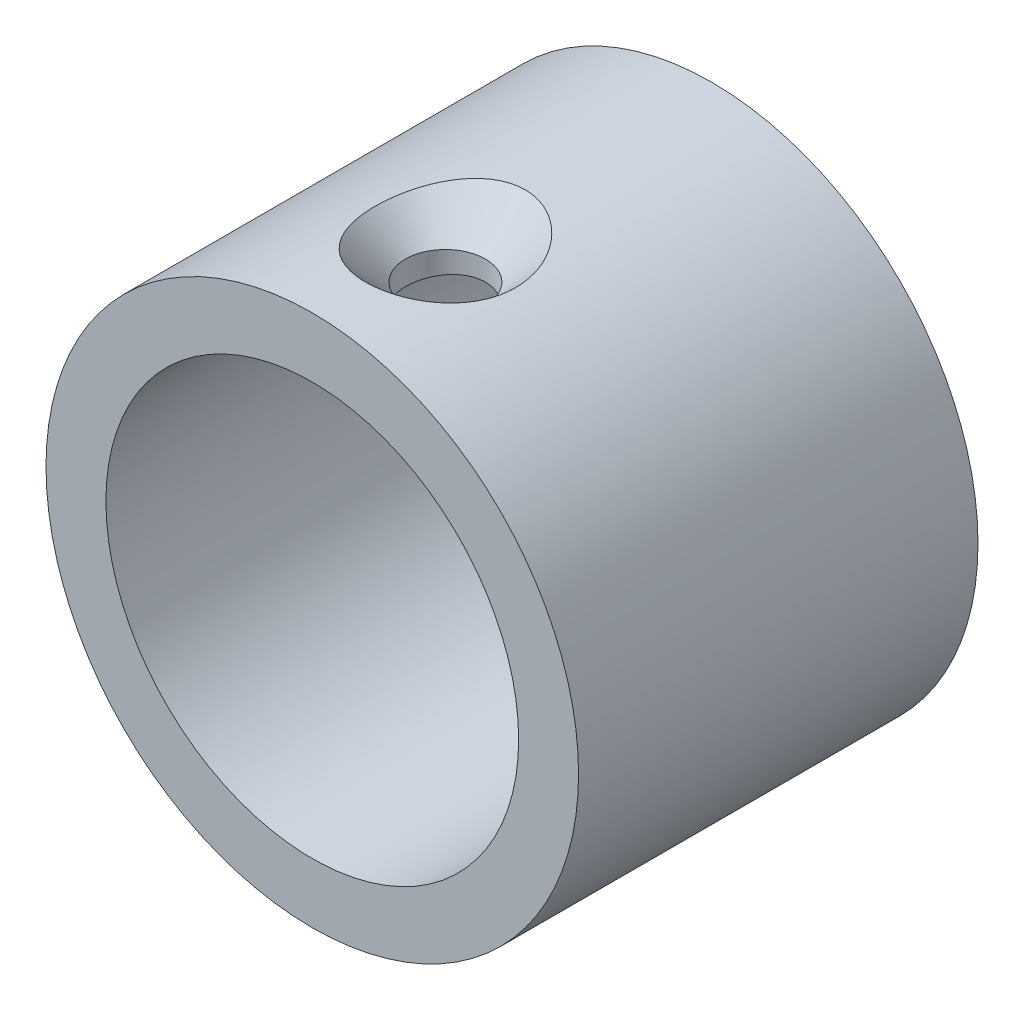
ISO-10303-21;
HEADER;
FILE_DESCRIPTION(('STEP AP214'),'2;1');
FILE_NAME('part.step','',(''),(''),'','','');
FILE_SCHEMA(('AUTOMOTIVE_DESIGN { 1 0 10303 214 1 1 1 1 }'));
ENDSEC;
DATA;
#1=APPLICATION_CONTEXT('core data for automotive mechanical design processes');
#2=APPLICATION_PROTOCOL_DEFINITION('international standard','automotive_design',2000,#1);
#3=PRODUCT_CONTEXT('',#1,'mechanical');
#4=PRODUCT('Part','Part','',(#3));
#5=PRODUCT_RELATED_PRODUCT_CATEGORY('part','',(#4));
#6=PRODUCT_DEFINITION_FORMATION('','',#4);
#7=PRODUCT_DEFINITION_CONTEXT('part definition',#1,'design');
#8=PRODUCT_DEFINITION('design','',#6,#7);
#9=PRODUCT_DEFINITION_SHAPE('','',#8);
#10=(LENGTH_UNIT() NAMED_UNIT(*) SI_UNIT(.MILLI.,.METRE.));
#11=(NAMED_UNIT(*) PLANE_ANGLE_UNIT() SI_UNIT($,.RADIAN.));
#12=(NAMED_UNIT(*) SI_UNIT($,.STERADIAN.) SOLID_ANGLE_UNIT());
#13=UNCERTAINTY_MEASURE_WITH_UNIT(LENGTH_MEASURE(1.E-05),#10,'distance_accuracy_value','');
#14=(GEOMETRIC_REPRESENTATION_CONTEXT(3) GLOBAL_UNCERTAINTY_ASSIGNED_CONTEXT((#13)) GLOBAL_UNIT_ASSIGNED_CONTEXT((#10,
#11,#12)) REPRESENTATION_CONTEXT('',''));
#15=CARTESIAN_POINT('',(0.,0.,0.));
#16=DIRECTION('',(0.,0.,1.));
#17=DIRECTION('',(1.,0.,0.));
#18=AXIS2_PLACEMENT_3D('',#15,#16,#17);
#19=CARTESIAN_POINT('',(0.,0.,15.));
#20=DIRECTION('',(0.,0.,-1.));
#21=DIRECTION('',(-1.,0.,0.));
#22=AXIS2_PLACEMENT_3D('',#19,#20,#21);
#23=CYLINDRICAL_SURFACE('',#22,15.5);
#24=CARTESIAN_POINT('',(0.,15.5,8.00000000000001));
#25=CARTESIAN_POINT('',(-0.16684215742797,15.4999969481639,7.99999373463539));
#26=CARTESIAN_POINT('',(-0.333764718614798,15.4972784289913,7.98603481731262));
#27=CARTESIAN_POINT('',(-0.662899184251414,15.4866958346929,7.93060790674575));
#28=CARTESIAN_POINT('',(-0.825107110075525,15.4788275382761,7.8891173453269));
#29=CARTESIAN_POINT('',(-1.14000531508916,15.4588248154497,7.77995076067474));
#30=CARTESIAN_POINT('',(-1.29270428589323,15.4466943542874,7.71229907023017));
#31=CARTESIAN_POINT('',(-1.58457198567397,15.4194891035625,7.55280123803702));
#32=CARTESIAN_POINT('',(-1.72374167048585,15.4044145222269,7.46095680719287));
#33=CARTESIAN_POINT('',(-1.98638335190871,15.3727681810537,7.25444093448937));
#34=CARTESIAN_POINT('',(-2.10965836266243,15.356181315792,7.13952126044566));
#35=CARTESIAN_POINT('',(-2.33530650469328,15.3234909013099,6.89065086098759));
#36=CARTESIAN_POINT('',(-2.43767807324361,15.3073873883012,6.75669871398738));
#37=CARTESIAN_POINT('',(-2.61944182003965,15.2773398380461,6.47216181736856));
#38=CARTESIAN_POINT('',(-2.6986319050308,15.2634152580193,6.32144573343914));
#39=CARTESIAN_POINT('',(-2.83049059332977,15.2395158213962,6.0085337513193));
#40=CARTESIAN_POINT('',(-2.88316164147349,15.2295406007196,5.84633891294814));
#41=CARTESIAN_POINT('',(-2.95985143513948,15.2148217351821,5.51718687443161));
#42=CARTESIAN_POINT('',(-2.98421471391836,15.2100152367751,5.3503128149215));
#43=CARTESIAN_POINT('',(-3.00466715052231,15.2059886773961,5.01478171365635));
#44=CARTESIAN_POINT('',(-3.0007590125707,15.2067680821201,4.84612484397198));
#45=CARTESIAN_POINT('',(-2.96505853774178,15.2137680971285,4.51432344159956));
#46=CARTESIAN_POINT('',(-2.93365948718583,15.2199119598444,4.35113473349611));
#47=CARTESIAN_POINT('',(-2.84448853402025,15.2368279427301,4.03238592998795));
#48=CARTESIAN_POINT('',(-2.78671544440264,15.2476002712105,3.87682617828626));
#49=CARTESIAN_POINT('',(-2.64605609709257,15.2726388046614,3.57660858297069));
#50=CARTESIAN_POINT('',(-2.56301242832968,15.2869267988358,3.43202638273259));
#51=CARTESIAN_POINT('',(-2.37428042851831,15.3173725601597,3.15870107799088));
#52=CARTESIAN_POINT('',(-2.26858965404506,15.3335305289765,3.0299596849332));
#53=CARTESIAN_POINT('',(-2.03545019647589,15.3662291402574,2.78969958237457));
#54=CARTESIAN_POINT('',(-1.90766546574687,15.3827716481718,2.67850695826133));
#55=CARTESIAN_POINT('',(-1.63508621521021,15.4141260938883,2.47908552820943));
#56=CARTESIAN_POINT('',(-1.49029150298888,15.4289380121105,2.39085698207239));
#57=CARTESIAN_POINT('',(-1.18745182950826,15.4551953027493,2.23981431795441));
#58=CARTESIAN_POINT('',(-1.02938872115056,15.4666359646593,2.1770357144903));
#59=CARTESIAN_POINT('',(-0.704689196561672,15.4848256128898,2.07901322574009));
#60=CARTESIAN_POINT('',(-0.538053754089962,15.4915751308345,2.04376622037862));
#61=CARTESIAN_POINT('',(-0.203743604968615,15.4995484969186,2.00226504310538));
#62=CARTESIAN_POINT('',(-0.0361262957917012,15.5008574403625,1.99556434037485));
#63=CARTESIAN_POINT('',(0.297833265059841,15.4980378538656,2.01014592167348));
#64=CARTESIAN_POINT('',(0.464175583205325,15.4939096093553,2.03142673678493));
#65=CARTESIAN_POINT('',(0.789435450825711,15.4807326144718,2.10099614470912));
#66=CARTESIAN_POINT('',(0.94840347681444,15.4717253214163,2.14905728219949));
#67=CARTESIAN_POINT('',(1.25602495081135,15.4497962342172,2.27057576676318));
#68=CARTESIAN_POINT('',(1.40467766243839,15.436874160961,2.34403492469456));
#69=CARTESIAN_POINT('',(1.6893437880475,15.4083367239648,2.51524188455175));
#70=CARTESIAN_POINT('',(1.82519124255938,15.3926919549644,2.61326062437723));
#71=CARTESIAN_POINT('',(2.07866993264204,15.3605171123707,2.83043956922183));
#72=CARTESIAN_POINT('',(2.19629934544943,15.3439869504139,2.94960188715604));
#73=CARTESIAN_POINT('',(2.41171234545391,15.3116199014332,3.20771236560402));
#74=CARTESIAN_POINT('',(2.50919032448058,15.2957961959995,3.346917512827));
#75=CARTESIAN_POINT('',(2.67938023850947,15.2669055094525,3.63998847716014));
#76=CARTESIAN_POINT('',(2.75209312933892,15.253838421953,3.79385372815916));
#77=CARTESIAN_POINT('',(2.87026314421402,15.2320453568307,4.11112581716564));
#78=CARTESIAN_POINT('',(2.91585659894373,15.2232977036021,4.2744803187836));
#79=CARTESIAN_POINT('',(2.97891074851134,15.2110861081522,4.60671767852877));
#80=CARTESIAN_POINT('',(2.99637485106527,15.2076215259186,4.77559986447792));
#81=CARTESIAN_POINT('',(3.00255473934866,15.2064022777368,5.11103410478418));
#82=CARTESIAN_POINT('',(2.99175298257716,15.208551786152,5.27757711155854));
#83=CARTESIAN_POINT('',(2.94276810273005,15.2181052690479,5.60642486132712));
#84=CARTESIAN_POINT('',(2.90458516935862,15.2255092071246,5.7687296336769));
#85=CARTESIAN_POINT('',(2.8021309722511,15.2446957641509,6.08421153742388));
#86=CARTESIAN_POINT('',(2.73791525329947,15.2564690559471,6.23740731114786));
#87=CARTESIAN_POINT('',(2.58527230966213,15.2830737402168,6.53092687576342));
#88=CARTESIAN_POINT('',(2.49684322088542,15.2979053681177,6.67124967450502));
#89=CARTESIAN_POINT('',(2.29662044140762,15.3292510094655,6.93744995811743));
#90=CARTESIAN_POINT('',(2.18447690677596,15.3457880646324,7.06306164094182));
#91=CARTESIAN_POINT('',(1.94073471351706,15.3785122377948,7.29384426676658));
#92=CARTESIAN_POINT('',(1.80913159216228,15.3946992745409,7.39901050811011));
#93=CARTESIAN_POINT('',(1.52867568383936,15.4250840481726,7.58687409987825));
#94=CARTESIAN_POINT('',(1.37966809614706,15.4392609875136,7.66934383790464));
#95=CARTESIAN_POINT('',(1.06968135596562,15.4638244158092,7.8079444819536));
#96=CARTESIAN_POINT('',(0.908713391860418,15.4742143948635,7.86409965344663));
#97=CARTESIAN_POINT('',(0.62277038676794,15.4879623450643,7.93732505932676));
#98=CARTESIAN_POINT('',(0.499446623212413,15.492450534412,7.96078717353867));
#99=CARTESIAN_POINT('',(0.250763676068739,15.4984704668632,7.99212677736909));
#100=CARTESIAN_POINT('',(0.125404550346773,15.5000022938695,8.00000470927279));
#101=CARTESIAN_POINT('',(0.,15.5,8.00000000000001));
#102=B_SPLINE_CURVE_WITH_KNOTS('',3,(#24,#25,#26,#27,#28,#29,#30,#31,#32,#33,#34,#35,#36,#37,
#38,#39,#40,#41,#42,#43,#44,#45,#46,#47,#48,#49,#50,#51,#52,#53,#54,#55,#56,#57,#58,#59,#60,#61,
#62,#63,#64,#65,#66,#67,#68,#69,#70,#71,#72,#73,#74,#75,#76,#77,#78,#79,#80,#81,#82,#83,#84,#85,
#86,#87,#88,#89,#90,#91,#92,#93,#94,#95,#96,#97,#98,#99,#100,#101),.UNSPECIFIED.,.T.,.F.,(4,2,2,
2,2,2,2,2,2,2,2,2,2,2,2,2,2,2,2,2,2,2,2,2,2,2,2,2,2,2,2,2,2,2,2,2,2,2,4),(0.,0.500067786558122,
1.0005459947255,1.50055981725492,2.00053828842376,2.50621507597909,3.01192965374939,
3.52192995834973,4.03188323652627,4.53556262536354,5.03919383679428,5.53573568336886,
6.03229987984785,6.53202279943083,7.0317996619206,7.53998224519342,8.0481705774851,
8.55706564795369,9.06590303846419,9.56675110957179,10.0675728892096,10.564204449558,
11.0608714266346,11.5632793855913,12.065737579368,12.5753323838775,13.0849075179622,
13.5918988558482,14.0988287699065,14.5971627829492,15.0954933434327,15.5927661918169,
16.090077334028,16.5953127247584,17.1006641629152,17.6109127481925,18.1206898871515,
18.4965694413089,18.8724383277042),.UNSPECIFIED.);
#103=CARTESIAN_POINT('',(0.,15.5,8.00000000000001));
#104=VERTEX_POINT('',#103);
#105=EDGE_CURVE('E39',#104,#104,#102,.T.);
#106=ORIENTED_EDGE('',*,*,#105,.F.);
#107=EDGE_LOOP('',(#106));
#108=FACE_BOUND('',#107,.T.);
#109=CARTESIAN_POINT('',(0.,0.,15.));
#110=DIRECTION('',(0.,0.,-1.));
#111=DIRECTION('',(1.,0.,0.));
#112=AXIS2_PLACEMENT_3D('',#109,#110,#111);
#113=CIRCLE('',#112,15.5);
#114=CARTESIAN_POINT('',(15.5,0.,15.));
#115=VERTEX_POINT('',#114);
#116=EDGE_CURVE('E11',#115,#115,#113,.T.);
#117=ORIENTED_EDGE('',*,*,#116,.F.);
#118=EDGE_LOOP('',(#117));
#119=FACE_BOUND('',#118,.T.);
#120=CARTESIAN_POINT('',(0.,0.,-15.));
#121=DIRECTION('',(0.,0.,-1.));
#122=DIRECTION('',(1.,0.,0.));
#123=AXIS2_PLACEMENT_3D('',#120,#121,#122);
#124=CIRCLE('',#123,15.5);
#125=CARTESIAN_POINT('',(15.5,0.,-15.));
#126=VERTEX_POINT('',#125);
#127=EDGE_CURVE('E28',#126,#126,#124,.T.);
#128=ORIENTED_EDGE('',*,*,#127,.T.);
#129=EDGE_LOOP('',(#128));
#130=FACE_BOUND('',#129,.T.);
#131=ADVANCED_FACE('F16',(#108,#119,#130),#23,.F.);
#132=CARTESIAN_POINT('',(0.,0.,15.));
#133=DIRECTION('',(0.,0.,-1.));
#134=DIRECTION('',(-1.,0.,0.));
#135=AXIS2_PLACEMENT_3D('',#132,#133,#134);
#136=CYLINDRICAL_SURFACE('',#135,20.);
#137=CARTESIAN_POINT('',(-4.4260156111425,19.5041121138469,1.72805339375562));
#138=CARTESIAN_POINT('',(-4.51460594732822,19.4840084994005,1.88170713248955));
#139=CARTESIAN_POINT('',(-4.59660976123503,19.4647674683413,2.03924469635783));
#140=CARTESIAN_POINT('',(-4.74721450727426,19.4285860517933,2.36092504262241));
#141=CARTESIAN_POINT('',(-4.81581085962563,19.4116464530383,2.52507005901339));
#142=CARTESIAN_POINT('',(-4.93938948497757,19.3805701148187,2.85887050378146));
#143=CARTESIAN_POINT('',(-4.99435627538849,19.3664365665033,3.02853195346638));
#144=CARTESIAN_POINT('',(-5.09039596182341,19.3414149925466,3.37204346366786));
#145=CARTESIAN_POINT('',(-5.13146365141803,19.330528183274,3.54589506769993));
#146=CARTESIAN_POINT('',(-5.19960662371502,19.31231057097,3.89695731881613));
#147=CARTESIAN_POINT('',(-5.22664638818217,19.3049887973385,4.07417532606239));
#148=CARTESIAN_POINT('',(-5.26647686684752,19.2941609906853,4.43038474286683));
#149=CARTESIAN_POINT('',(-5.27926246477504,19.2906563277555,4.60937676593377));
#150=CARTESIAN_POINT('',(-5.29051118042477,19.2875743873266,4.9677164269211));
#151=CARTESIAN_POINT('',(-5.28898448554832,19.2879943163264,5.14706372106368));
#152=CARTESIAN_POINT('',(-5.27163627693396,19.292742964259,5.50507929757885));
#153=CARTESIAN_POINT('',(-5.2558095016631,19.2970731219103,5.68374730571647));
#154=CARTESIAN_POINT('',(-5.20949844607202,19.3096274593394,6.04235739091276));
#155=CARTESIAN_POINT('',(-5.17875205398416,19.3179212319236,6.22226325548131));
#156=CARTESIAN_POINT('',(-5.10260800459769,19.3381731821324,6.57880502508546));
#157=CARTESIAN_POINT('',(-5.0572051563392,19.350132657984,6.7554397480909));
#158=CARTESIAN_POINT('',(-4.95191977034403,19.3773436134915,7.10411532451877));
#159=CARTESIAN_POINT('',(-4.89203480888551,19.3925956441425,7.27615540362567));
#160=CARTESIAN_POINT('',(-4.75801508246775,19.4259120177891,7.61430931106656));
#161=CARTESIAN_POINT('',(-4.68388085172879,19.4439762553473,7.78042336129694));
#162=CARTESIAN_POINT('',(-4.52232123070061,19.4821826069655,8.10403014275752));
#163=CARTESIAN_POINT('',(-4.43501433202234,19.5023057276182,8.26158421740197));
#164=CARTESIAN_POINT('',(-4.24700803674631,19.5441088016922,8.56818602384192));
#165=CARTESIAN_POINT('',(-4.14631461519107,19.565788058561,8.71723750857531));
#166=CARTESIAN_POINT('',(-3.9318336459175,19.6100146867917,9.00559148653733));
#167=CARTESIAN_POINT('',(-3.8180399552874,19.6325624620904,9.14488935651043));
#168=CARTESIAN_POINT('',(-3.57793696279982,19.6777354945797,9.41211743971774));
#169=CARTESIAN_POINT('',(-3.45163488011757,19.7003606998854,9.54005413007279));
#170=CARTESIAN_POINT('',(-3.19543384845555,19.7434797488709,9.77542156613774));
#171=CARTESIAN_POINT('',(-3.0662633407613,19.7640180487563,9.88363652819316));
#172=CARTESIAN_POINT('',(-2.79819033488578,19.8037489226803,10.0873922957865));
#173=CARTESIAN_POINT('',(-2.65929388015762,19.8229423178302,10.1829408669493));
#174=CARTESIAN_POINT('',(-2.37270394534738,19.8592828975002,10.359989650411));
#175=CARTESIAN_POINT('',(-2.22501775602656,19.876431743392,10.4415012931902));
#176=CARTESIAN_POINT('',(-1.92189823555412,19.9080261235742,10.5892074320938));
#177=CARTESIAN_POINT('',(-1.76646641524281,19.9224721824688,10.6554049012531));
#178=CARTESIAN_POINT('',(-1.47104004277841,19.9463003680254,10.7633009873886));
#179=CARTESIAN_POINT('',(-1.33184933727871,19.956105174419,10.8071138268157));
#180=CARTESIAN_POINT('',(-1.04986896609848,19.9729245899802,10.8817342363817));
#181=CARTESIAN_POINT('',(-0.907079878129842,19.9799396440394,10.9125438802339));
#182=CARTESIAN_POINT('',(-0.619211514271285,19.9909301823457,10.9606258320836));
#183=CARTESIAN_POINT('',(-0.474133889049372,19.9949077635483,10.9779074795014));
#184=CARTESIAN_POINT('',(-0.182990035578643,19.9996942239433,10.9986807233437));
#185=CARTESIAN_POINT('',(-0.036923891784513,20.0005033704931,11.0021734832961));
#186=CARTESIAN_POINT('',(0.366818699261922,19.9982888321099,10.9925983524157));
#187=CARTESIAN_POINT('',(0.624283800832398,19.9918544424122,10.9647956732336));
#188=CARTESIAN_POINT('',(1.13051529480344,19.9696355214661,10.8672760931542));
#189=CARTESIAN_POINT('',(1.37928189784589,19.9538512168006,10.7975602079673));
#190=CARTESIAN_POINT('',(1.86178971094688,19.9146257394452,10.6198037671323));
#191=CARTESIAN_POINT('',(2.09554123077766,19.8911898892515,10.5117898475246));
#192=CARTESIAN_POINT('',(2.54349014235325,19.8388917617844,10.2619840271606));
#193=CARTESIAN_POINT('',(2.75768145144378,19.8100278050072,10.1201816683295));
#194=CARTESIAN_POINT('',(3.18365405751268,19.7462733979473,9.79189581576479));
#195=CARTESIAN_POINT('',(3.39302466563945,19.7110687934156,9.60235229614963));
#196=CARTESIAN_POINT('',(3.78130017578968,19.6402852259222,9.19436875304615));
#197=CARTESIAN_POINT('',(3.96018932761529,19.6047060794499,8.9759138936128));
#198=CARTESIAN_POINT('',(4.30729387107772,19.5315843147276,8.48512266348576));
#199=CARTESIAN_POINT('',(4.47091831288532,19.4944108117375,8.20948480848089));
#200=CARTESIAN_POINT('',(4.75477395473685,19.4271333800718,7.63574655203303));
#201=CARTESIAN_POINT('',(4.87498651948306,19.3970324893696,7.33763657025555));
#202=CARTESIAN_POINT('',(5.02630349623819,19.3581826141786,6.86472466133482));
#203=CARTESIAN_POINT('',(5.07312904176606,19.3459310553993,6.69506147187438));
#204=CARTESIAN_POINT('',(5.15316205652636,19.3247680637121,6.3523620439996));
#205=CARTESIAN_POINT('',(5.18637333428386,19.3158556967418,6.17932676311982));
#206=CARTESIAN_POINT('',(5.23906500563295,19.3016304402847,5.830958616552));
#207=CARTESIAN_POINT('',(5.25853890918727,19.2963192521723,5.65562470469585));
#208=CARTESIAN_POINT('',(5.28365584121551,19.2894570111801,5.30395277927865));
#209=CARTESIAN_POINT('',(5.28930338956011,19.2879047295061,5.12761511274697));
#210=CARTESIAN_POINT('',(5.28671436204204,19.2886146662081,4.76921035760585));
#211=CARTESIAN_POINT('',(5.27801228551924,19.2910047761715,4.58714671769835));
#212=CARTESIAN_POINT('',(5.24587165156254,19.2997695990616,4.22442207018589));
#213=CARTESIAN_POINT('',(5.22243306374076,19.3061443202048,4.04376106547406));
#214=CARTESIAN_POINT('',(5.16091041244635,19.3226814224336,3.68509056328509));
#215=CARTESIAN_POINT('',(5.12282368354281,19.3328444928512,3.50708155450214));
#216=CARTESIAN_POINT('',(5.03215765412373,19.3566418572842,3.15503401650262));
#217=CARTESIAN_POINT('',(4.97957878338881,19.3702760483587,2.98099536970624));
#218=CARTESIAN_POINT('',(4.86009058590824,19.4006009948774,2.63805735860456));
#219=CARTESIAN_POINT('',(4.79317240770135,19.4172936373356,2.46916124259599));
#220=CARTESIAN_POINT('',(4.64530030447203,19.4531994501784,2.13798674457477));
#221=CARTESIAN_POINT('',(4.56435228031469,19.4724115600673,1.97570561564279));
#222=CARTESIAN_POINT('',(4.38863322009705,19.5127657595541,1.65890583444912));
#223=CARTESIAN_POINT('',(4.29385295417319,19.5339091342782,1.50439245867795));
#224=CARTESIAN_POINT('',(4.09090790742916,19.5774164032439,1.20469947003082));
#225=CARTESIAN_POINT('',(3.98274986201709,19.5997796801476,1.05951521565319));
#226=CARTESIAN_POINT('',(3.75758440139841,19.6441656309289,0.784899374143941));
#227=CARTESIAN_POINT('',(3.64103665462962,19.6661715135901,0.655088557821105));
#228=CARTESIAN_POINT('',(3.39643503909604,19.709887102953,0.406863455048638));
#229=CARTESIAN_POINT('',(3.26838769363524,19.7315969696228,0.28844278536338));
#230=CARTESIAN_POINT('',(3.00140706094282,19.7739681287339,0.0643969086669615));
#231=CARTESIAN_POINT('',(2.86247584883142,19.7946296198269,-0.0412307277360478));
#232=CARTESIAN_POINT('',(2.57465174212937,19.8341180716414,-0.23813775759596));
#233=CARTESIAN_POINT('',(2.42576578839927,19.8529462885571,-0.329427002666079));
#234=CARTESIAN_POINT('',(2.13663918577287,19.8860115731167,-0.486671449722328));
#235=CARTESIAN_POINT('',(1.99735589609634,19.9005274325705,-0.554329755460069));
#236=CARTESIAN_POINT('',(1.71288323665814,19.9270274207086,-0.676216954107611));
#237=CARTESIAN_POINT('',(1.56769757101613,19.9390131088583,-0.730454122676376));
#238=CARTESIAN_POINT('',(1.27264677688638,19.960015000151,-0.824601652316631));
#239=CARTESIAN_POINT('',(1.12278544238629,19.9690335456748,-0.864523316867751));
#240=CARTESIAN_POINT('',(0.819751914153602,19.9837704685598,-0.92937647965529));
#241=CARTESIAN_POINT('',(0.666580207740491,19.9894893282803,-0.954310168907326));
#242=CARTESIAN_POINT('',(0.247250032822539,20.0002207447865,-1.00103882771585));
#243=CARTESIAN_POINT('',(-0.0208675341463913,20.001761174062,-1.00765295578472));
#244=CARTESIAN_POINT('',(-0.553837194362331,19.9941100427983,-0.974443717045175));
#245=CARTESIAN_POINT('',(-0.818690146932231,19.9849213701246,-0.934632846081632));
#246=CARTESIAN_POINT('',(-1.32478533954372,19.9576080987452,-0.813970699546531));
#247=CARTESIAN_POINT('',(-1.56655049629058,19.9399345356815,-0.735185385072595));
#248=CARTESIAN_POINT('',(-2.03442229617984,19.8976481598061,-0.541399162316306));
#249=CARTESIAN_POINT('',(-2.26052323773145,19.873032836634,-0.426385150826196));
#250=CARTESIAN_POINT('',(-2.70794265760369,19.8172000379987,-0.155495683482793));
#251=CARTESIAN_POINT('',(-2.92782268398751,19.7856413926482,0.00267363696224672));
#252=CARTESIAN_POINT('',(-3.34129037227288,19.720031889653,0.349594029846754));
#253=CARTESIAN_POINT('',(-3.53488563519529,19.685981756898,0.538336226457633));
#254=CARTESIAN_POINT('',(-3.84943666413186,19.6265326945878,0.891420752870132));
#255=CARTESIAN_POINT('',(-3.97654707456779,19.6010658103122,1.05034637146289));
#256=CARTESIAN_POINT('',(-4.21400289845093,19.5513912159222,1.38049324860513));
#257=CARTESIAN_POINT('',(-4.32434666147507,19.5271836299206,1.55171571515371));
#258=CARTESIAN_POINT('',(-4.4260156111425,19.5041121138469,1.72805339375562));
#259=B_SPLINE_CURVE_WITH_KNOTS('',3,(#137,#138,#139,#140,#141,#142,#143,#144,#145,#146,#147,
#148,#149,#150,#151,#152,#153,#154,#155,#156,#157,#158,#159,#160,#161,#162,#163,#164,#165,#166,
#167,#168,#169,#170,#171,#172,#173,#174,#175,#176,#177,#178,#179,#180,#181,#182,#183,#184,#185,
#186,#187,#188,#189,#190,#191,#192,#193,#194,#195,#196,#197,#198,#199,#200,#201,#202,#203,#204,
#205,#206,#207,#208,#209,#210,#211,#212,#213,#214,#215,#216,#217,#218,#219,#220,#221,#222,#223,
#224,#225,#226,#227,#228,#229,#230,#231,#232,#233,#234,#235,#236,#237,#238,#239,#240,#241,#242,
#243,#244,#245,#246,#247,#248,#249,#250,#251,#252,#253,#254,#255,#256,#257,#258),.UNSPECIFIED.,
.T.,.F.,(4,2,2,2,2,2,2,2,2,2,2,2,2,2,2,2,2,2,2,2,2,2,2,2,2,2,2,2,2,2,2,2,2,2,2,2,2,2,2,2,2,2,2,
2,2,2,2,2,2,2,2,2,2,2,2,2,2,2,2,2,4),(0.,0.535299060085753,1.07078065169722,1.60686776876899,
2.14315547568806,2.68079449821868,3.21862643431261,3.75607557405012,4.29372254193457,
4.84117712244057,5.38882581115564,5.93656621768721,6.48428609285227,7.02734430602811,
7.57016093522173,8.11323314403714,8.65599372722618,9.16454521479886,9.67278345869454,
10.180605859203,10.688329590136,11.1264680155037,11.5645365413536,12.0023023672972,
12.4400312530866,13.2130591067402,13.9860682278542,14.7585407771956,15.5312527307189,
16.3817088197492,17.232603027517,18.1967679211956,19.161346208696,19.6901402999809,
20.2187863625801,20.7476820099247,21.2764047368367,21.8226188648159,22.3688341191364,
22.9151488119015,23.4614473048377,24.0080839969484,24.5544913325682,25.1012649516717,
25.6477643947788,26.17455970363,26.7010580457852,27.2274562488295,27.7534911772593,
28.2193920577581,28.6850049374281,29.1502493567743,29.6154257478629,30.4154736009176,
31.215306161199,31.976670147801,32.7383098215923,33.5531761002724,34.3678062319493,
34.9820712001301,35.5963965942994),.UNSPECIFIED.);
#260=CARTESIAN_POINT('',(-4.4260156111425,19.5041121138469,1.72805339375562));
#261=VERTEX_POINT('',#260);
#262=EDGE_CURVE('E46',#261,#261,#259,.T.);
#263=ORIENTED_EDGE('',*,*,#262,.F.);
#264=EDGE_LOOP('',(#263));
#265=FACE_BOUND('',#264,.T.);
#266=CARTESIAN_POINT('',(0.,0.,-15.));
#267=DIRECTION('',(0.,0.,-1.));
#268=DIRECTION('',(1.,0.,0.));
#269=AXIS2_PLACEMENT_3D('',#266,#267,#268);
#270=CIRCLE('',#269,20.);
#271=CARTESIAN_POINT('',(20.,0.,-15.));
#272=VERTEX_POINT('',#271);
#273=EDGE_CURVE('E33',#272,#272,#270,.T.);
#274=ORIENTED_EDGE('',*,*,#273,.F.);
#275=EDGE_LOOP('',(#274));
#276=FACE_BOUND('',#275,.T.);
#277=CARTESIAN_POINT('',(0.,0.,15.));
#278=DIRECTION('',(0.,0.,-1.));
#279=DIRECTION('',(1.,0.,0.));
#280=AXIS2_PLACEMENT_3D('',#277,#278,#279);
#281=CIRCLE('',#280,20.);
#282=CARTESIAN_POINT('',(20.,0.,15.));
#283=VERTEX_POINT('',#282);
#284=EDGE_CURVE('E24',#283,#283,#281,.T.);
#285=ORIENTED_EDGE('',*,*,#284,.T.);
#286=EDGE_LOOP('',(#285));
#287=FACE_BOUND('',#286,.T.);
#288=ADVANCED_FACE('F18',(#265,#276,#287),#136,.T.);
#289=CARTESIAN_POINT('',(0.,0.,15.));
#290=DIRECTION('',(0.,0.,-1.));
#291=DIRECTION('',(-1.,0.,0.));
#292=AXIS2_PLACEMENT_3D('',#289,#290,#291);
#293=PLANE('',#292);
#294=ORIENTED_EDGE('',*,*,#116,.T.);
#295=EDGE_LOOP('',(#294));
#296=FACE_BOUND('',#295,.T.);
#297=ORIENTED_EDGE('',*,*,#284,.F.);
#298=EDGE_LOOP('',(#297));
#299=FACE_BOUND('',#298,.T.);
#300=ADVANCED_FACE('F72',(#296,#299),#293,.F.);
#301=CARTESIAN_POINT('',(0.,0.,-15.));
#302=DIRECTION('',(0.,0.,-1.));
#303=DIRECTION('',(-1.,0.,0.));
#304=AXIS2_PLACEMENT_3D('',#301,#302,#303);
#305=PLANE('',#304);
#306=ORIENTED_EDGE('',*,*,#127,.F.);
#307=EDGE_LOOP('',(#306));
#308=FACE_BOUND('',#307,.T.);
#309=ORIENTED_EDGE('',*,*,#273,.T.);
#310=EDGE_LOOP('',(#309));
#311=FACE_BOUND('',#310,.T.);
#312=ADVANCED_FACE('F57',(#308,#311),#305,.T.);
#313=CARTESIAN_POINT('',(0.,-47.0312423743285,5.));
#314=DIRECTION('',(0.,1.,0.));
#315=DIRECTION('',(0.,0.,1.));
#316=AXIS2_PLACEMENT_3D('',#313,#314,#315);
#317=CYLINDRICAL_SURFACE('',#316,3.);
#318=ORIENTED_EDGE('',*,*,#105,.T.);
#319=EDGE_LOOP('',(#318));
#320=FACE_BOUND('',#319,.T.);
#321=CARTESIAN_POINT('',(0.,17.,5.));
#322=DIRECTION('',(0.,1.,0.));
#323=DIRECTION('',(0.,0.,-1.));
#324=AXIS2_PLACEMENT_3D('',#321,#322,#323);
#325=CIRCLE('',#324,3.);
#326=CARTESIAN_POINT('',(0.,17.,2.));
#327=VERTEX_POINT('',#326);
#328=EDGE_CURVE('E171',#327,#327,#325,.T.);
#329=ORIENTED_EDGE('',*,*,#328,.T.);
#330=EDGE_LOOP('',(#329));
#331=FACE_BOUND('',#330,.T.);
#332=ADVANCED_FACE('F53',(#320,#331),#317,.F.);
#333=CARTESIAN_POINT('',(0.,20.,5.));
#334=DIRECTION('',(0.,1.,0.));
#335=DIRECTION('',(0.,0.,-1.));
#336=AXIS2_PLACEMENT_3D('',#333,#334,#335);
#337=CONICAL_SURFACE('',#336,6.,0.785398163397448);
#338=ORIENTED_EDGE('',*,*,#262,.T.);
#339=EDGE_LOOP('',(#338));
#340=FACE_BOUND('',#339,.T.);
#341=ORIENTED_EDGE('',*,*,#328,.F.);
#342=EDGE_LOOP('',(#341));
#343=FACE_BOUND('',#342,.T.);
#344=ADVANCED_FACE('F56',(#340,#343),#337,.F.);
#345=CLOSED_SHELL('',(#131,#288,#300,#312,#332,#344));
#346=MANIFOLD_SOLID_BREP('B1',#345);
#347=ADVANCED_BREP_SHAPE_REPRESENTATION('',(#18,#346),#14);
#348=SHAPE_DEFINITION_REPRESENTATION(#9,#347);
ENDSEC;
END-ISO-10303-21;
